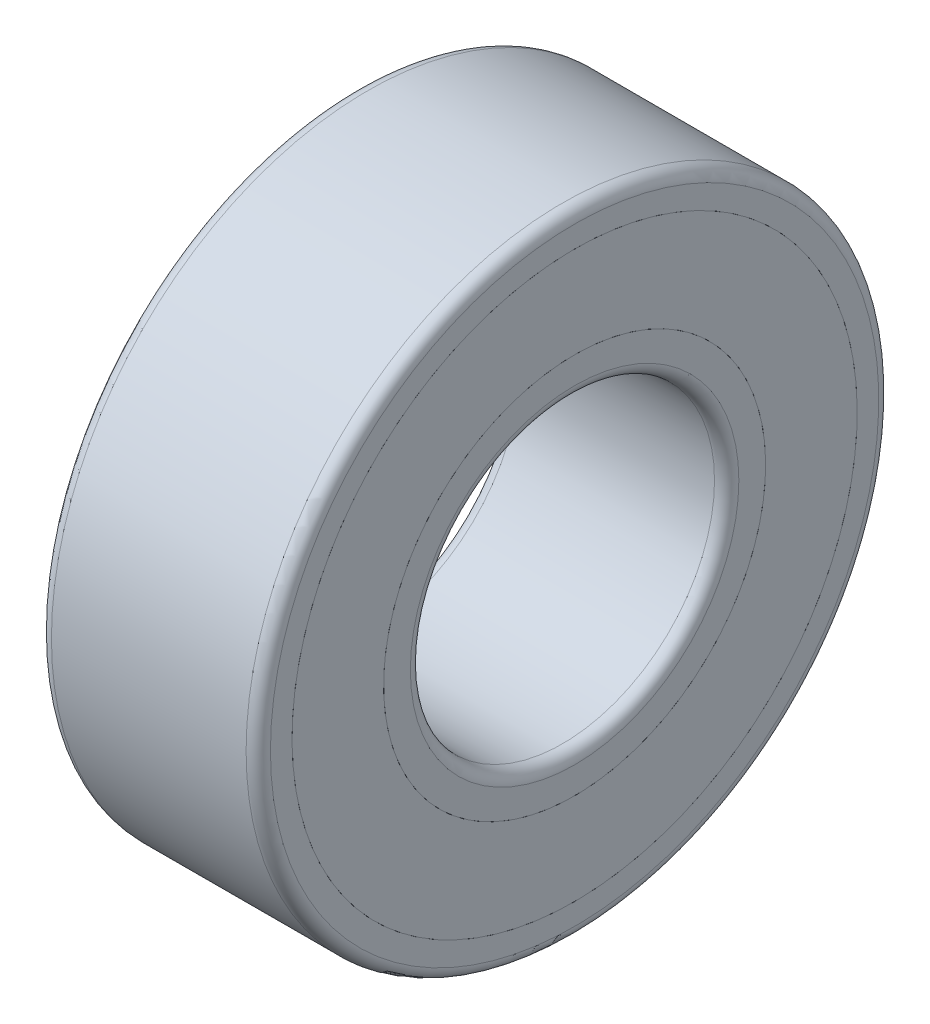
ISO-10303-21;
HEADER;
FILE_DESCRIPTION(('STEP AP214'),'2;1');
FILE_NAME('part.step','',(''),(''),'','','');
FILE_SCHEMA(('AUTOMOTIVE_DESIGN { 1 0 10303 214 1 1 1 1 }'));
ENDSEC;
DATA;
#1=APPLICATION_CONTEXT('core data for automotive mechanical design processes');
#2=APPLICATION_PROTOCOL_DEFINITION('international standard','automotive_design',2000,#1);
#3=PRODUCT_CONTEXT('',#1,'mechanical');
#4=PRODUCT('Part','Part','',(#3));
#5=PRODUCT_RELATED_PRODUCT_CATEGORY('part','',(#4));
#6=PRODUCT_DEFINITION_FORMATION('','',#4);
#7=PRODUCT_DEFINITION_CONTEXT('part definition',#1,'design');
#8=PRODUCT_DEFINITION('design','',#6,#7);
#9=PRODUCT_DEFINITION_SHAPE('','',#8);
#10=(LENGTH_UNIT() NAMED_UNIT(*) SI_UNIT(.MILLI.,.METRE.));
#11=(NAMED_UNIT(*) PLANE_ANGLE_UNIT() SI_UNIT($,.RADIAN.));
#12=(NAMED_UNIT(*) SI_UNIT($,.STERADIAN.) SOLID_ANGLE_UNIT());
#13=UNCERTAINTY_MEASURE_WITH_UNIT(LENGTH_MEASURE(1.E-05),#10,'distance_accuracy_value','');
#14=(GEOMETRIC_REPRESENTATION_CONTEXT(3) GLOBAL_UNCERTAINTY_ASSIGNED_CONTEXT((#13)) GLOBAL_UNIT_ASSIGNED_CONTEXT((#10,
#11,#12)) REPRESENTATION_CONTEXT('',''));
#15=CARTESIAN_POINT('',(0.,0.,0.));
#16=DIRECTION('',(0.,0.,1.));
#17=DIRECTION('',(1.,0.,0.));
#18=AXIS2_PLACEMENT_3D('',#15,#16,#17);
#19=CARTESIAN_POINT('',(-6.66678115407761,0.,0.));
#20=DIRECTION('',(-1.,0.,0.));
#21=DIRECTION('',(0.,-1.,0.));
#22=AXIS2_PLACEMENT_3D('',#19,#20,#21);
#23=CYLINDRICAL_SURFACE('',#22,16.45);
#24=CARTESIAN_POINT('',(-7.5,0.,0.));
#25=DIRECTION('',(-1.,0.,0.));
#26=DIRECTION('',(0.,0.,-1.));
#27=AXIS2_PLACEMENT_3D('',#24,#25,#26);
#28=CIRCLE('',#27,16.45);
#29=CARTESIAN_POINT('',(-7.50000000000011,16.45,0.));
#30=VERTEX_POINT('',#29);
#31=EDGE_CURVE('P0_E119',#30,#30,#28,.T.);
#32=ORIENTED_EDGE('',*,*,#31,.F.);
#33=EDGE_LOOP('',(#32));
#34=FACE_BOUND('',#33,.T.);
#35=CARTESIAN_POINT('',(-5.83356230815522,0.,0.));
#36=DIRECTION('',(-1.,0.,0.));
#37=DIRECTION('',(0.,0.,-1.));
#38=AXIS2_PLACEMENT_3D('',#35,#36,#37);
#39=CIRCLE('',#38,16.45);
#40=CARTESIAN_POINT('',(-5.83356230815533,16.45,0.));
#41=VERTEX_POINT('',#40);
#42=EDGE_CURVE('P0_E10',#41,#41,#39,.T.);
#43=ORIENTED_EDGE('',*,*,#42,.T.);
#44=EDGE_LOOP('',(#43));
#45=FACE_BOUND('',#44,.T.);
#46=ADVANCED_FACE('P0_F16',(#34,#45),#23,.T.);
#47=CARTESIAN_POINT('',(-3.38,0.,0.));
#48=DIRECTION('',(-1.,0.,0.));
#49=DIRECTION('',(0.,0.,-1.));
#50=AXIS2_PLACEMENT_3D('',#47,#48,#49);
#51=TOROIDAL_SURFACE('',#50,19.046,3.572);
#52=CARTESIAN_POINT('',(-0.926437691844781,0.,0.));
#53=DIRECTION('',(-1.,0.,0.));
#54=DIRECTION('',(0.,0.,-1.));
#55=AXIS2_PLACEMENT_3D('',#52,#53,#54);
#56=CIRCLE('',#55,16.45);
#57=CARTESIAN_POINT('',(-0.926437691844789,0.,16.45));
#58=VERTEX_POINT('',#57);
#59=EDGE_CURVE('P0_E27',#58,#58,#56,.T.);
#60=ORIENTED_EDGE('',*,*,#59,.T.);
#61=EDGE_LOOP('',(#60));
#62=FACE_BOUND('',#61,.T.);
#63=ORIENTED_EDGE('',*,*,#42,.F.);
#64=EDGE_LOOP('',(#63));
#65=FACE_BOUND('',#64,.T.);
#66=ADVANCED_FACE('P0_F141',(#62,#65),#51,.F.);
#67=CARTESIAN_POINT('',(0.,0.,0.));
#68=DIRECTION('',(-1.,0.,0.));
#69=DIRECTION('',(0.,-1.,0.));
#70=AXIS2_PLACEMENT_3D('',#67,#68,#69);
#71=CYLINDRICAL_SURFACE('',#70,16.45);
#72=ORIENTED_EDGE('',*,*,#59,.F.);
#73=EDGE_LOOP('',(#72));
#74=FACE_BOUND('',#73,.T.);
#75=CARTESIAN_POINT('',(0.926437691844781,0.,0.));
#76=DIRECTION('',(-1.,0.,0.));
#77=DIRECTION('',(0.,0.,-1.));
#78=AXIS2_PLACEMENT_3D('',#75,#76,#77);
#79=CIRCLE('',#78,16.45);
#80=CARTESIAN_POINT('',(0.926437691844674,16.45,0.));
#81=VERTEX_POINT('',#80);
#82=EDGE_CURVE('P0_E125',#81,#81,#79,.T.);
#83=ORIENTED_EDGE('',*,*,#82,.T.);
#84=EDGE_LOOP('',(#83));
#85=FACE_BOUND('',#84,.T.);
#86=ADVANCED_FACE('P0_F146',(#74,#85),#71,.T.);
#87=CARTESIAN_POINT('',(3.38,0.,0.));
#88=DIRECTION('',(-1.,0.,0.));
#89=DIRECTION('',(0.,0.,-1.));
#90=AXIS2_PLACEMENT_3D('',#87,#88,#89);
#91=TOROIDAL_SURFACE('',#90,19.046,3.572);
#92=CARTESIAN_POINT('',(5.83356230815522,0.,0.));
#93=DIRECTION('',(-1.,0.,0.));
#94=DIRECTION('',(0.,0.,-1.));
#95=AXIS2_PLACEMENT_3D('',#92,#93,#94);
#96=CIRCLE('',#95,16.45);
#97=CARTESIAN_POINT('',(5.83356230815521,0.,16.45));
#98=VERTEX_POINT('',#97);
#99=EDGE_CURVE('P0_E109',#98,#98,#96,.T.);
#100=ORIENTED_EDGE('',*,*,#99,.T.);
#101=EDGE_LOOP('',(#100));
#102=FACE_BOUND('',#101,.T.);
#103=ORIENTED_EDGE('',*,*,#82,.F.);
#104=EDGE_LOOP('',(#103));
#105=FACE_BOUND('',#104,.T.);
#106=ADVANCED_FACE('P0_F152',(#102,#105),#91,.F.);
#107=CARTESIAN_POINT('',(6.66678115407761,0.,0.));
#108=DIRECTION('',(-1.,0.,0.));
#109=DIRECTION('',(0.,-1.,0.));
#110=AXIS2_PLACEMENT_3D('',#107,#108,#109);
#111=CYLINDRICAL_SURFACE('',#110,16.45);
#112=ORIENTED_EDGE('',*,*,#99,.F.);
#113=EDGE_LOOP('',(#112));
#114=FACE_BOUND('',#113,.T.);
#115=CARTESIAN_POINT('',(7.5,0.,0.));
#116=DIRECTION('',(-1.,0.,0.));
#117=DIRECTION('',(0.,0.,-1.));
#118=AXIS2_PLACEMENT_3D('',#115,#116,#117);
#119=CIRCLE('',#118,16.45);
#120=CARTESIAN_POINT('',(7.49999999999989,16.45,0.));
#121=VERTEX_POINT('',#120);
#122=EDGE_CURVE('P0_E102',#121,#121,#119,.T.);
#123=ORIENTED_EDGE('',*,*,#122,.T.);
#124=EDGE_LOOP('',(#123));
#125=FACE_BOUND('',#124,.T.);
#126=ADVANCED_FACE('P0_F161',(#114,#125),#111,.T.);
#127=CARTESIAN_POINT('',(7.50000000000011,-16.45,0.));
#128=DIRECTION('',(1.,0.,0.));
#129=DIRECTION('',(0.,0.,1.));
#130=AXIS2_PLACEMENT_3D('',#127,#128,#129);
#131=PLANE('',#130);
#132=CARTESIAN_POINT('',(7.5,0.,0.));
#133=DIRECTION('',(-1.,0.,0.));
#134=DIRECTION('',(0.,0.,-1.));
#135=AXIS2_PLACEMENT_3D('',#132,#133,#134);
#136=CIRCLE('',#135,15.7);
#137=CARTESIAN_POINT('',(7.4999999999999,15.7,0.));
#138=VERTEX_POINT('',#137);
#139=EDGE_CURVE('P0_E97',#138,#138,#136,.T.);
#140=ORIENTED_EDGE('',*,*,#139,.T.);
#141=EDGE_LOOP('',(#140));
#142=FACE_BOUND('',#141,.T.);
#143=ORIENTED_EDGE('',*,*,#122,.F.);
#144=EDGE_LOOP('',(#143));
#145=FACE_BOUND('',#144,.T.);
#146=ADVANCED_FACE('P0_F98',(#142,#145),#131,.T.);
#147=CARTESIAN_POINT('',(8.25,0.,0.));
#148=DIRECTION('',(-1.,0.,0.));
#149=DIRECTION('',(0.,-1.,0.));
#150=AXIS2_PLACEMENT_3D('',#147,#148,#149);
#151=CYLINDRICAL_SURFACE('',#150,15.7);
#152=ORIENTED_EDGE('',*,*,#139,.F.);
#153=EDGE_LOOP('',(#152));
#154=FACE_BOUND('',#153,.T.);
#155=CARTESIAN_POINT('',(9.,0.,0.));
#156=DIRECTION('',(-1.,0.,0.));
#157=DIRECTION('',(0.,0.,-1.));
#158=AXIS2_PLACEMENT_3D('',#155,#156,#157);
#159=CIRCLE('',#158,15.7);
#160=CARTESIAN_POINT('',(8.9999999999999,15.7,0.));
#161=VERTEX_POINT('',#160);
#162=EDGE_CURVE('P0_E103',#161,#161,#159,.T.);
#163=ORIENTED_EDGE('',*,*,#162,.T.);
#164=EDGE_LOOP('',(#163));
#165=FACE_BOUND('',#164,.T.);
#166=ADVANCED_FACE('P0_F160',(#154,#165),#151,.T.);
#167=CARTESIAN_POINT('',(9.0000000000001,-15.7,0.));
#168=DIRECTION('',(1.,0.,0.));
#169=DIRECTION('',(0.,0.,1.));
#170=AXIS2_PLACEMENT_3D('',#167,#168,#169);
#171=PLANE('',#170);
#172=CARTESIAN_POINT('',(9.,0.,0.));
#173=DIRECTION('',(-1.,0.,0.));
#174=DIRECTION('',(0.,0.,-1.));
#175=AXIS2_PLACEMENT_3D('',#172,#173,#174);
#176=CIRCLE('',#175,13.5);
#177=CARTESIAN_POINT('',(9.,0.,13.5));
#178=VERTEX_POINT('',#177);
#179=EDGE_CURVE('P0_E52',#178,#178,#176,.T.);
#180=ORIENTED_EDGE('',*,*,#179,.T.);
#181=EDGE_LOOP('',(#180));
#182=FACE_BOUND('',#181,.T.);
#183=ORIENTED_EDGE('',*,*,#162,.F.);
#184=EDGE_LOOP('',(#183));
#185=FACE_BOUND('',#184,.T.);
#186=ADVANCED_FACE('P0_F164',(#182,#185),#171,.T.);
#187=CARTESIAN_POINT('',(8.,0.,0.));
#188=DIRECTION('',(-1.,0.,0.));
#189=DIRECTION('',(0.,0.,-1.));
#190=AXIS2_PLACEMENT_3D('',#187,#188,#189);
#191=TOROIDAL_SURFACE('',#190,13.5,1.);
#192=ORIENTED_EDGE('',*,*,#179,.F.);
#193=EDGE_LOOP('',(#192));
#194=FACE_BOUND('',#193,.T.);
#195=CARTESIAN_POINT('',(8.,0.,0.));
#196=DIRECTION('',(-1.,0.,0.));
#197=DIRECTION('',(0.,0.,-1.));
#198=AXIS2_PLACEMENT_3D('',#195,#196,#197);
#199=CIRCLE('',#198,12.5);
#200=CARTESIAN_POINT('',(8.,0.,12.5));
#201=VERTEX_POINT('',#200);
#202=EDGE_CURVE('P0_E20',#201,#201,#199,.T.);
#203=ORIENTED_EDGE('',*,*,#202,.T.);
#204=EDGE_LOOP('',(#203));
#205=FACE_BOUND('',#204,.T.);
#206=ADVANCED_FACE('P0_F157',(#194,#205),#191,.T.);
#207=CARTESIAN_POINT('',(0.,0.,0.));
#208=DIRECTION('',(-1.,0.,0.));
#209=DIRECTION('',(0.,-1.,0.));
#210=AXIS2_PLACEMENT_3D('',#207,#208,#209);
#211=CYLINDRICAL_SURFACE('',#210,12.5);
#212=CARTESIAN_POINT('',(-8.,0.,0.));
#213=DIRECTION('',(-1.,0.,0.));
#214=DIRECTION('',(0.,0.,-1.));
#215=AXIS2_PLACEMENT_3D('',#212,#213,#214);
#216=CIRCLE('',#215,12.5);
#217=CARTESIAN_POINT('',(-8.,0.,12.5));
#218=VERTEX_POINT('',#217);
#219=EDGE_CURVE('P0_E72',#218,#218,#216,.T.);
#220=ORIENTED_EDGE('',*,*,#219,.T.);
#221=EDGE_LOOP('',(#220));
#222=FACE_BOUND('',#221,.T.);
#223=ORIENTED_EDGE('',*,*,#202,.F.);
#224=EDGE_LOOP('',(#223));
#225=FACE_BOUND('',#224,.T.);
#226=ADVANCED_FACE('P0_F154',(#222,#225),#211,.F.);
#227=CARTESIAN_POINT('',(-8.,0.,0.));
#228=DIRECTION('',(-1.,0.,0.));
#229=DIRECTION('',(0.,0.,-1.));
#230=AXIS2_PLACEMENT_3D('',#227,#228,#229);
#231=TOROIDAL_SURFACE('',#230,13.5,1.);
#232=ORIENTED_EDGE('',*,*,#219,.F.);
#233=EDGE_LOOP('',(#232));
#234=FACE_BOUND('',#233,.T.);
#235=CARTESIAN_POINT('',(-9.,0.,0.));
#236=DIRECTION('',(-1.,0.,0.));
#237=DIRECTION('',(0.,0.,-1.));
#238=AXIS2_PLACEMENT_3D('',#235,#236,#237);
#239=CIRCLE('',#238,13.5);
#240=CARTESIAN_POINT('',(-9.,0.,13.5));
#241=VERTEX_POINT('',#240);
#242=EDGE_CURVE('P0_E123',#241,#241,#239,.T.);
#243=ORIENTED_EDGE('',*,*,#242,.T.);
#244=EDGE_LOOP('',(#243));
#245=FACE_BOUND('',#244,.T.);
#246=ADVANCED_FACE('P0_F18',(#234,#245),#231,.T.);
#247=CARTESIAN_POINT('',(-9.,-13.5,0.));
#248=DIRECTION('',(-1.,0.,0.));
#249=DIRECTION('',(0.,-1.,0.));
#250=AXIS2_PLACEMENT_3D('',#247,#248,#249);
#251=PLANE('',#250);
#252=ORIENTED_EDGE('',*,*,#242,.F.);
#253=EDGE_LOOP('',(#252));
#254=FACE_BOUND('',#253,.T.);
#255=CARTESIAN_POINT('',(-9.,0.,0.));
#256=DIRECTION('',(-1.,0.,0.));
#257=DIRECTION('',(0.,0.,-1.));
#258=AXIS2_PLACEMENT_3D('',#255,#256,#257);
#259=CIRCLE('',#258,15.7);
#260=CARTESIAN_POINT('',(-9.0000000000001,15.7,0.));
#261=VERTEX_POINT('',#260);
#262=EDGE_CURVE('P0_E118',#261,#261,#259,.T.);
#263=ORIENTED_EDGE('',*,*,#262,.T.);
#264=EDGE_LOOP('',(#263));
#265=FACE_BOUND('',#264,.T.);
#266=ADVANCED_FACE('P0_F169',(#254,#265),#251,.T.);
#267=CARTESIAN_POINT('',(-8.25,0.,0.));
#268=DIRECTION('',(-1.,0.,0.));
#269=DIRECTION('',(0.,-1.,0.));
#270=AXIS2_PLACEMENT_3D('',#267,#268,#269);
#271=CYLINDRICAL_SURFACE('',#270,15.7);
#272=ORIENTED_EDGE('',*,*,#262,.F.);
#273=EDGE_LOOP('',(#272));
#274=FACE_BOUND('',#273,.T.);
#275=CARTESIAN_POINT('',(-7.5,0.,0.));
#276=DIRECTION('',(-1.,0.,0.));
#277=DIRECTION('',(0.,0.,-1.));
#278=AXIS2_PLACEMENT_3D('',#275,#276,#277);
#279=CIRCLE('',#278,15.7);
#280=CARTESIAN_POINT('',(-7.5000000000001,15.7,0.));
#281=VERTEX_POINT('',#280);
#282=EDGE_CURVE('P0_E116',#281,#281,#279,.T.);
#283=ORIENTED_EDGE('',*,*,#282,.T.);
#284=EDGE_LOOP('',(#283));
#285=FACE_BOUND('',#284,.T.);
#286=ADVANCED_FACE('P0_F166',(#274,#285),#271,.T.);
#287=CARTESIAN_POINT('',(-7.4999999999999,-15.7,0.));
#288=DIRECTION('',(-1.,0.,0.));
#289=DIRECTION('',(0.,-1.,0.));
#290=AXIS2_PLACEMENT_3D('',#287,#288,#289);
#291=PLANE('',#290);
#292=ORIENTED_EDGE('',*,*,#282,.F.);
#293=EDGE_LOOP('',(#292));
#294=FACE_BOUND('',#293,.T.);
#295=ORIENTED_EDGE('',*,*,#31,.T.);
#296=EDGE_LOOP('',(#295));
#297=FACE_BOUND('',#296,.T.);
#298=ADVANCED_FACE('P0_F138',(#294,#297),#291,.T.);
#299=CLOSED_SHELL('',(#46,#66,#86,#106,#126,#146,#166,#186,#206,#226,#246,#266,#286,#298));
#300=MANIFOLD_SOLID_BREP('P0_B1',#299);
#301=CARTESIAN_POINT('',(0.,0.,0.));
#302=DIRECTION('',(1.,0.,0.));
#303=DIRECTION('',(0.,1.,0.));
#304=AXIS2_PLACEMENT_3D('',#301,#302,#303);
#305=CYLINDRICAL_SURFACE('',#304,26.);
#306=CARTESIAN_POINT('',(8.,0.,0.));
#307=DIRECTION('',(1.,0.,0.));
#308=DIRECTION('',(0.,0.,-1.));
#309=AXIS2_PLACEMENT_3D('',#306,#307,#308);
#310=CIRCLE('',#309,26.);
#311=CARTESIAN_POINT('',(8.,-26.,0.));
#312=VERTEX_POINT('',#311);
#313=EDGE_CURVE('P1_E97',#312,#312,#310,.T.);
#314=ORIENTED_EDGE('',*,*,#313,.F.);
#315=EDGE_LOOP('',(#314));
#316=FACE_BOUND('',#315,.T.);
#317=CARTESIAN_POINT('',(-8.,0.,0.));
#318=DIRECTION('',(1.,0.,0.));
#319=DIRECTION('',(0.,0.,-1.));
#320=AXIS2_PLACEMENT_3D('',#317,#318,#319);
#321=CIRCLE('',#320,26.);
#322=CARTESIAN_POINT('',(-8.,0.,26.));
#323=VERTEX_POINT('',#322);
#324=EDGE_CURVE('P1_E11',#323,#323,#321,.T.);
#325=ORIENTED_EDGE('',*,*,#324,.T.);
#326=EDGE_LOOP('',(#325));
#327=FACE_BOUND('',#326,.T.);
#328=ADVANCED_FACE('P1_F17',(#316,#327),#305,.T.);
#329=CARTESIAN_POINT('',(-8.,0.,0.));
#330=DIRECTION('',(1.,0.,0.));
#331=DIRECTION('',(0.,0.,-1.));
#332=AXIS2_PLACEMENT_3D('',#329,#330,#331);
#333=TOROIDAL_SURFACE('',#332,25.,1.);
#334=ORIENTED_EDGE('',*,*,#324,.F.);
#335=EDGE_LOOP('',(#334));
#336=FACE_BOUND('',#335,.T.);
#337=CARTESIAN_POINT('',(-9.,0.,0.));
#338=DIRECTION('',(1.,0.,0.));
#339=DIRECTION('',(0.,0.,-1.));
#340=AXIS2_PLACEMENT_3D('',#337,#338,#339);
#341=CIRCLE('',#340,25.);
#342=CARTESIAN_POINT('',(-9.,0.,25.));
#343=VERTEX_POINT('',#342);
#344=EDGE_CURVE('P1_E28',#343,#343,#341,.T.);
#345=ORIENTED_EDGE('',*,*,#344,.T.);
#346=EDGE_LOOP('',(#345));
#347=FACE_BOUND('',#346,.T.);
#348=ADVANCED_FACE('P1_F19',(#336,#347),#333,.T.);
#349=CARTESIAN_POINT('',(-9.,25.,0.));
#350=DIRECTION('',(-1.,0.,0.));
#351=DIRECTION('',(0.,0.,1.));
#352=AXIS2_PLACEMENT_3D('',#349,#350,#351);
#353=PLANE('',#352);
#354=CARTESIAN_POINT('',(-9.,0.,0.));
#355=DIRECTION('',(1.,0.,0.));
#356=DIRECTION('',(0.,0.,-1.));
#357=AXIS2_PLACEMENT_3D('',#354,#355,#356);
#358=CIRCLE('',#357,23.225);
#359=CARTESIAN_POINT('',(-9.,-23.225,0.));
#360=VERTEX_POINT('',#359);
#361=EDGE_CURVE('P1_E89',#360,#360,#358,.T.);
#362=ORIENTED_EDGE('',*,*,#361,.T.);
#363=EDGE_LOOP('',(#362));
#364=FACE_BOUND('',#363,.T.);
#365=ORIENTED_EDGE('',*,*,#344,.F.);
#366=EDGE_LOOP('',(#365));
#367=FACE_BOUND('',#366,.T.);
#368=ADVANCED_FACE('P1_F112',(#364,#367),#353,.T.);
#369=CARTESIAN_POINT('',(-8.25,0.,0.));
#370=DIRECTION('',(1.,0.,0.));
#371=DIRECTION('',(0.,1.,0.));
#372=AXIS2_PLACEMENT_3D('',#369,#370,#371);
#373=CYLINDRICAL_SURFACE('',#372,23.225);
#374=CARTESIAN_POINT('',(-7.5,0.,0.));
#375=DIRECTION('',(1.,0.,0.));
#376=DIRECTION('',(0.,0.,-1.));
#377=AXIS2_PLACEMENT_3D('',#374,#375,#376);
#378=CIRCLE('',#377,23.225);
#379=CARTESIAN_POINT('',(-7.5,-23.225,0.));
#380=VERTEX_POINT('',#379);
#381=EDGE_CURVE('P1_E21',#380,#380,#378,.T.);
#382=ORIENTED_EDGE('',*,*,#381,.T.);
#383=EDGE_LOOP('',(#382));
#384=FACE_BOUND('',#383,.T.);
#385=ORIENTED_EDGE('',*,*,#361,.F.);
#386=EDGE_LOOP('',(#385));
#387=FACE_BOUND('',#386,.T.);
#388=ADVANCED_FACE('P1_F122',(#384,#387),#373,.F.);
#389=CARTESIAN_POINT('',(-7.5,23.225,0.));
#390=DIRECTION('',(-1.,0.,0.));
#391=DIRECTION('',(0.,0.,1.));
#392=AXIS2_PLACEMENT_3D('',#389,#390,#391);
#393=PLANE('',#392);
#394=CARTESIAN_POINT('',(-7.5,0.,0.));
#395=DIRECTION('',(1.,0.,0.));
#396=DIRECTION('',(0.,0.,-1.));
#397=AXIS2_PLACEMENT_3D('',#394,#395,#396);
#398=CIRCLE('',#397,21.6528802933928);
#399=CARTESIAN_POINT('',(-7.5,0.,21.6528802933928));
#400=VERTEX_POINT('',#399);
#401=EDGE_CURVE('P1_E82',#400,#400,#398,.T.);
#402=ORIENTED_EDGE('',*,*,#401,.T.);
#403=EDGE_LOOP('',(#402));
#404=FACE_BOUND('',#403,.T.);
#405=ORIENTED_EDGE('',*,*,#381,.F.);
#406=EDGE_LOOP('',(#405));
#407=FACE_BOUND('',#406,.T.);
#408=ADVANCED_FACE('P1_F127',(#404,#407),#393,.T.);
#409=CARTESIAN_POINT('',(0.,0.,0.));
#410=DIRECTION('',(0.,0.,1.));
#411=DIRECTION('',(1.,0.,0.));
#412=AXIS2_PLACEMENT_3D('',#409,#410,#411);
#413=SPHERICAL_SURFACE('',#412,22.915);
#414=CARTESIAN_POINT('',(0.,0.,0.));
#415=DIRECTION('',(1.,0.,0.));
#416=DIRECTION('',(0.,0.,-1.));
#417=AXIS2_PLACEMENT_3D('',#414,#415,#416);
#418=SPHERICAL_SURFACE('',#417,22.915);
#419=CARTESIAN_POINT('',(7.5,0.,0.));
#420=DIRECTION('',(1.,0.,0.));
#421=DIRECTION('',(0.,0.,-1.));
#422=AXIS2_PLACEMENT_3D('',#419,#420,#421);
#423=CIRCLE('',#422,21.6528802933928);
#424=CARTESIAN_POINT('',(7.5,21.6528802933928,0.));
#425=VERTEX_POINT('',#424);
#426=EDGE_CURVE('P1_E66',#425,#425,#423,.T.);
#427=ORIENTED_EDGE('',*,*,#426,.T.);
#428=EDGE_LOOP('',(#427));
#429=FACE_BOUND('',#428,.T.);
#430=ORIENTED_EDGE('',*,*,#401,.F.);
#431=EDGE_LOOP('',(#430));
#432=FACE_BOUND('',#431,.T.);
#433=ADVANCED_FACE('P1_F116',(#429,#432),#418,.F.);
#434=CARTESIAN_POINT('',(7.5,21.6528802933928,0.));
#435=DIRECTION('',(1.,0.,0.));
#436=DIRECTION('',(0.,1.,0.));
#437=AXIS2_PLACEMENT_3D('',#434,#435,#436);
#438=PLANE('',#437);
#439=ORIENTED_EDGE('',*,*,#426,.F.);
#440=EDGE_LOOP('',(#439));
#441=FACE_BOUND('',#440,.T.);
#442=CARTESIAN_POINT('',(7.5,0.,0.));
#443=DIRECTION('',(1.,0.,0.));
#444=DIRECTION('',(0.,0.,-1.));
#445=AXIS2_PLACEMENT_3D('',#442,#443,#444);
#446=CIRCLE('',#445,23.225);
#447=CARTESIAN_POINT('',(7.5,-23.225,0.));
#448=VERTEX_POINT('',#447);
#449=EDGE_CURVE('P1_E72',#448,#448,#446,.T.);
#450=ORIENTED_EDGE('',*,*,#449,.T.);
#451=EDGE_LOOP('',(#450));
#452=FACE_BOUND('',#451,.T.);
#453=ADVANCED_FACE('P1_F73',(#441,#452),#438,.T.);
#454=CARTESIAN_POINT('',(8.25,0.,0.));
#455=DIRECTION('',(1.,0.,0.));
#456=DIRECTION('',(0.,1.,0.));
#457=AXIS2_PLACEMENT_3D('',#454,#455,#456);
#458=CYLINDRICAL_SURFACE('',#457,23.225);
#459=CARTESIAN_POINT('',(9.,0.,0.));
#460=DIRECTION('',(1.,0.,0.));
#461=DIRECTION('',(0.,0.,-1.));
#462=AXIS2_PLACEMENT_3D('',#459,#460,#461);
#463=CIRCLE('',#462,23.225);
#464=CARTESIAN_POINT('',(9.,-23.225,0.));
#465=VERTEX_POINT('',#464);
#466=EDGE_CURVE('P1_E76',#465,#465,#463,.T.);
#467=ORIENTED_EDGE('',*,*,#466,.T.);
#468=EDGE_LOOP('',(#467));
#469=FACE_BOUND('',#468,.T.);
#470=ORIENTED_EDGE('',*,*,#449,.F.);
#471=EDGE_LOOP('',(#470));
#472=FACE_BOUND('',#471,.T.);
#473=ADVANCED_FACE('P1_F142',(#469,#472),#458,.F.);
#474=CARTESIAN_POINT('',(9.,23.225,0.));
#475=DIRECTION('',(1.,0.,0.));
#476=DIRECTION('',(0.,1.,0.));
#477=AXIS2_PLACEMENT_3D('',#474,#475,#476);
#478=PLANE('',#477);
#479=ORIENTED_EDGE('',*,*,#466,.F.);
#480=EDGE_LOOP('',(#479));
#481=FACE_BOUND('',#480,.T.);
#482=CARTESIAN_POINT('',(9.,0.,0.));
#483=DIRECTION('',(1.,0.,0.));
#484=DIRECTION('',(0.,0.,-1.));
#485=AXIS2_PLACEMENT_3D('',#482,#483,#484);
#486=CIRCLE('',#485,25.);
#487=CARTESIAN_POINT('',(9.,0.,25.));
#488=VERTEX_POINT('',#487);
#489=EDGE_CURVE('P1_E84',#488,#488,#486,.T.);
#490=ORIENTED_EDGE('',*,*,#489,.T.);
#491=EDGE_LOOP('',(#490));
#492=FACE_BOUND('',#491,.T.);
#493=ADVANCED_FACE('P1_F119',(#481,#492),#478,.T.);
#494=CARTESIAN_POINT('',(8.,0.,0.));
#495=DIRECTION('',(1.,0.,0.));
#496=DIRECTION('',(0.,0.,-1.));
#497=AXIS2_PLACEMENT_3D('',#494,#495,#496);
#498=TOROIDAL_SURFACE('',#497,25.,1.);
#499=ORIENTED_EDGE('',*,*,#489,.F.);
#500=EDGE_LOOP('',(#499));
#501=FACE_BOUND('',#500,.T.);
#502=ORIENTED_EDGE('',*,*,#313,.T.);
#503=EDGE_LOOP('',(#502));
#504=FACE_BOUND('',#503,.T.);
#505=ADVANCED_FACE('P1_F104',(#501,#504),#498,.T.);
#506=CLOSED_SHELL('',(#328,#348,#368,#388,#408,#433,#453,#473,#493,#505));
#507=MANIFOLD_SOLID_BREP('P1_B1',#506);
#508=CARTESIAN_POINT('',(3.38000000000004,-19.046,0.));
#509=DIRECTION('',(0.925213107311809,-0.276991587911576,0.259338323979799));
#510=DIRECTION('',(0.376970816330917,0.748950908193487,-0.544945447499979));
#511=AXIS2_PLACEMENT_3D('',#508,#509,#510);
#512=SPHERICAL_SURFACE('',#511,3.572);
#513=CARTESIAN_POINT('',(6.68486121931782,-20.0354139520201,0.926356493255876));
#514=VERTEX_POINT('',#513);
#515=VERTEX_LOOP('',#514);
#516=FACE_BOUND('',#515,.T.);
#517=ADVANCED_FACE('P2_F13',(#516),#512,.T.);
#518=CLOSED_SHELL('',(#517));
#519=MANIFOLD_SOLID_BREP('P2_B1',#518);
#520=CARTESIAN_POINT('',(3.3799999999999,0.,19.046));
#521=DIRECTION('',(0.925213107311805,0.259338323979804,0.276991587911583));
#522=DIRECTION('',(0.376970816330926,-0.544945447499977,-0.748950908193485));
#523=AXIS2_PLACEMENT_3D('',#520,#521,#522);
#524=SPHERICAL_SURFACE('',#523,3.572);
#525=CARTESIAN_POINT('',(6.68486121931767,0.926356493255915,20.0354139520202));
#526=VERTEX_POINT('',#525);
#527=VERTEX_LOOP('',#526);
#528=FACE_BOUND('',#527,.T.);
#529=ADVANCED_FACE('P3_F13',(#528),#524,.T.);
#530=CLOSED_SHELL('',(#529));
#531=MANIFOLD_SOLID_BREP('P3_B1',#530);
#532=CARTESIAN_POINT('',(3.37999999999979,19.046,0.));
#533=DIRECTION('',(0.925213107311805,0.276991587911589,-0.259338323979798));
#534=DIRECTION('',(0.376970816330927,-0.748950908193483,0.544945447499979));
#535=AXIS2_PLACEMENT_3D('',#532,#533,#534);
#536=SPHERICAL_SURFACE('',#535,3.572);
#537=CARTESIAN_POINT('',(6.68486121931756,20.0354139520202,-0.926356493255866));
#538=VERTEX_POINT('',#537);
#539=VERTEX_LOOP('',#538);
#540=FACE_BOUND('',#539,.T.);
#541=ADVANCED_FACE('P4_F13',(#540),#536,.T.);
#542=CLOSED_SHELL('',(#541));
#543=MANIFOLD_SOLID_BREP('P4_B1',#542);
#544=CARTESIAN_POINT('',(3.37999999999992,0.,-19.046));
#545=DIRECTION('',(0.925213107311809,-0.259338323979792,-0.276991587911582));
#546=DIRECTION('',(0.376970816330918,0.544945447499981,0.748950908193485));
#547=AXIS2_PLACEMENT_3D('',#544,#545,#546);
#548=SPHERICAL_SURFACE('',#547,3.572);
#549=CARTESIAN_POINT('',(6.6848612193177,-0.926356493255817,-20.0354139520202));
#550=VERTEX_POINT('',#549);
#551=VERTEX_LOOP('',#550);
#552=FACE_BOUND('',#551,.T.);
#553=ADVANCED_FACE('P5_F13',(#552),#548,.T.);
#554=CLOSED_SHELL('',(#553));
#555=MANIFOLD_SOLID_BREP('P5_B1',#554);
#556=CARTESIAN_POINT('',(-3.38000000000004,-13.467555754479,13.467555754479));
#557=DIRECTION('',(-0.596689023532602,-0.775223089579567,-0.207343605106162));
#558=DIRECTION('',(0.135871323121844,-0.352248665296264,0.925991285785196));
#559=AXIS2_PLACEMENT_3D('',#556,#557,#558);
#560=SPHERICAL_SURFACE('',#559,3.572);
#561=CARTESIAN_POINT('',(-5.51137319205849,-16.2366526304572,12.7269243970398));
#562=VERTEX_POINT('',#561);
#563=VERTEX_LOOP('',#562);
#564=FACE_BOUND('',#563,.T.);
#565=ADVANCED_FACE('P6_F13',(#564),#560,.T.);
#566=CLOSED_SHELL('',(#565));
#567=MANIFOLD_SOLID_BREP('P6_B1',#566);
#568=CARTESIAN_POINT('',(-3.38000000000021,13.467555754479,13.467555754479));
#569=DIRECTION('',(-0.596689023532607,-0.207343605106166,0.775223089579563));
#570=DIRECTION('',(0.135871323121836,0.925991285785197,0.352248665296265));
#571=AXIS2_PLACEMENT_3D('',#568,#569,#570);
#572=SPHERICAL_SURFACE('',#571,3.572);
#573=CARTESIAN_POINT('',(-5.51137319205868,12.7269243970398,16.2366526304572));
#574=VERTEX_POINT('',#573);
#575=VERTEX_LOOP('',#574);
#576=FACE_BOUND('',#575,.T.);
#577=ADVANCED_FACE('P7_F13',(#576),#572,.T.);
#578=CLOSED_SHELL('',(#577));
#579=MANIFOLD_SOLID_BREP('P7_B1',#578);
#580=CARTESIAN_POINT('',(-3.3800000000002,13.467555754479,-13.467555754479));
#581=DIRECTION('',(-0.596689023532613,0.775223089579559,0.207343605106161));
#582=DIRECTION('',(0.135871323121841,0.352248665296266,-0.925991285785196));
#583=AXIS2_PLACEMENT_3D('',#580,#581,#582);
#584=SPHERICAL_SURFACE('',#583,3.572);
#585=CARTESIAN_POINT('',(-5.51137319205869,16.2366526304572,-12.7269243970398));
#586=VERTEX_POINT('',#585);
#587=VERTEX_LOOP('',#586);
#588=FACE_BOUND('',#587,.T.);
#589=ADVANCED_FACE('P8_F13',(#588),#584,.T.);
#590=CLOSED_SHELL('',(#589));
#591=MANIFOLD_SOLID_BREP('P8_B1',#590);
#592=CARTESIAN_POINT('',(-3.38,-13.467555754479,-13.467555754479));
#593=DIRECTION('',(-0.596689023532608,0.207343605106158,-0.775223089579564));
#594=DIRECTION('',(0.135871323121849,-0.925991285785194,-0.352248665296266));
#595=AXIS2_PLACEMENT_3D('',#592,#593,#594);
#596=SPHERICAL_SURFACE('',#595,3.572);
#597=CARTESIAN_POINT('',(-5.51137319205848,-12.7269243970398,-16.2366526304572));
#598=VERTEX_POINT('',#597);
#599=VERTEX_LOOP('',#598);
#600=FACE_BOUND('',#599,.T.);
#601=ADVANCED_FACE('P9_F13',(#600),#596,.T.);
#602=CLOSED_SHELL('',(#601));
#603=MANIFOLD_SOLID_BREP('P9_B1',#602);
#604=CARTESIAN_POINT('',(-9.,-14.0188379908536,18.5168249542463));
#605=DIRECTION('',(-1.,0.,0.));
#606=DIRECTION('',(0.,-0.79727986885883,-0.603609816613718));
#607=AXIS2_PLACEMENT_3D('',#604,#605,#606);
#608=PLANE('',#607);
#609=CARTESIAN_POINT('',(-9.,0.,0.));
#610=DIRECTION('',(1.,0.,0.));
#611=DIRECTION('',(0.,0.79727986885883,0.603609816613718));
#612=AXIS2_PLACEMENT_3D('',#609,#610,#611);
#613=CIRCLE('',#612,15.7);
#614=CARTESIAN_POINT('',(-9.,9.47667412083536,-12.5172939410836));
#615=VERTEX_POINT('',#614);
#616=EDGE_CURVE('P10_E11',#615,#615,#613,.T.);
#617=ORIENTED_EDGE('',*,*,#616,.T.);
#618=EDGE_LOOP('',(#617));
#619=FACE_BOUND('',#618,.T.);
#620=CARTESIAN_POINT('',(-9.,0.,0.));
#621=DIRECTION('',(1.,0.,0.));
#622=DIRECTION('',(0.,0.79727986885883,0.603609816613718));
#623=AXIS2_PLACEMENT_3D('',#620,#621,#622);
#624=CIRCLE('',#623,23.225);
#625=CARTESIAN_POINT('',(-9.,14.0188379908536,-18.5168249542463));
#626=VERTEX_POINT('',#625);
#627=EDGE_CURVE('P10_E21',#626,#626,#624,.T.);
#628=ORIENTED_EDGE('',*,*,#627,.F.);
#629=EDGE_LOOP('',(#628));
#630=FACE_BOUND('',#629,.T.);
#631=ADVANCED_FACE('P10_F17',(#619,#630),#608,.T.);
#632=CARTESIAN_POINT('',(-8.25,0.,0.));
#633=DIRECTION('',(1.,0.,0.));
#634=DIRECTION('',(0.,-0.603609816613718,0.79727986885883));
#635=AXIS2_PLACEMENT_3D('',#632,#633,#634);
#636=CYLINDRICAL_SURFACE('',#635,15.7);
#637=CARTESIAN_POINT('',(-7.5,0.,0.));
#638=DIRECTION('',(1.,0.,0.));
#639=DIRECTION('',(0.,0.79727986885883,0.603609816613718));
#640=AXIS2_PLACEMENT_3D('',#637,#638,#639);
#641=CIRCLE('',#640,15.7);
#642=CARTESIAN_POINT('',(-7.5,9.47667412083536,-12.5172939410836));
#643=VERTEX_POINT('',#642);
#644=EDGE_CURVE('P10_E28',#643,#643,#641,.T.);
#645=ORIENTED_EDGE('',*,*,#644,.T.);
#646=EDGE_LOOP('',(#645));
#647=FACE_BOUND('',#646,.T.);
#648=ORIENTED_EDGE('',*,*,#616,.F.);
#649=EDGE_LOOP('',(#648));
#650=FACE_BOUND('',#649,.T.);
#651=ADVANCED_FACE('P10_F64',(#647,#650),#636,.F.);
#652=CARTESIAN_POINT('',(-7.5,-9.47667412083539,12.5172939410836));
#653=DIRECTION('',(1.,0.,0.));
#654=DIRECTION('',(0.,-0.603609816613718,0.79727986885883));
#655=AXIS2_PLACEMENT_3D('',#652,#653,#654);
#656=PLANE('',#655);
#657=ORIENTED_EDGE('',*,*,#644,.F.);
#658=EDGE_LOOP('',(#657));
#659=FACE_BOUND('',#658,.T.);
#660=CARTESIAN_POINT('',(-7.5,0.,0.));
#661=DIRECTION('',(1.,0.,0.));
#662=DIRECTION('',(0.,0.79727986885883,0.603609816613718));
#663=AXIS2_PLACEMENT_3D('',#660,#661,#662);
#664=CIRCLE('',#663,23.225);
#665=CARTESIAN_POINT('',(-7.5,14.0188379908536,-18.5168249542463));
#666=VERTEX_POINT('',#665);
#667=EDGE_CURVE('P10_E46',#666,#666,#664,.T.);
#668=ORIENTED_EDGE('',*,*,#667,.T.);
#669=EDGE_LOOP('',(#668));
#670=FACE_BOUND('',#669,.T.);
#671=ADVANCED_FACE('P10_F67',(#659,#670),#656,.T.);
#672=CARTESIAN_POINT('',(-8.25,0.,0.));
#673=DIRECTION('',(1.,0.,0.));
#674=DIRECTION('',(0.,-0.603609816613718,0.79727986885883));
#675=AXIS2_PLACEMENT_3D('',#672,#673,#674);
#676=CYLINDRICAL_SURFACE('',#675,23.225);
#677=ORIENTED_EDGE('',*,*,#667,.F.);
#678=EDGE_LOOP('',(#677));
#679=FACE_BOUND('',#678,.T.);
#680=ORIENTED_EDGE('',*,*,#627,.T.);
#681=EDGE_LOOP('',(#680));
#682=FACE_BOUND('',#681,.T.);
#683=ADVANCED_FACE('P10_F19',(#679,#682),#676,.T.);
#684=CLOSED_SHELL('',(#631,#651,#671,#683));
#685=MANIFOLD_SOLID_BREP('P10_B1',#684);
#686=CARTESIAN_POINT('',(9.,20.7212041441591,10.4896293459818));
#687=DIRECTION('',(1.,0.,0.));
#688=DIRECTION('',(0.,0.451652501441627,-0.892193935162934));
#689=AXIS2_PLACEMENT_3D('',#686,#687,#688);
#690=PLANE('',#689);
#691=CARTESIAN_POINT('',(9.,0.,0.));
#692=DIRECTION('',(-1.,0.,0.));
#693=DIRECTION('',(0.,-0.451652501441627,0.892193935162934));
#694=AXIS2_PLACEMENT_3D('',#691,#692,#693);
#695=CIRCLE('',#694,15.7);
#696=CARTESIAN_POINT('',(9.,-14.007444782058,-7.09094427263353));
#697=VERTEX_POINT('',#696);
#698=EDGE_CURVE('P11_E10',#697,#697,#695,.T.);
#699=ORIENTED_EDGE('',*,*,#698,.T.);
#700=EDGE_LOOP('',(#699));
#701=FACE_BOUND('',#700,.T.);
#702=CARTESIAN_POINT('',(9.,0.,0.));
#703=DIRECTION('',(-1.,0.,0.));
#704=DIRECTION('',(0.,-0.451652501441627,0.892193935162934));
#705=AXIS2_PLACEMENT_3D('',#702,#703,#704);
#706=CIRCLE('',#705,23.225);
#707=CARTESIAN_POINT('',(9.,-20.7212041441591,-10.4896293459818));
#708=VERTEX_POINT('',#707);
#709=EDGE_CURVE('P11_E49',#708,#708,#706,.T.);
#710=ORIENTED_EDGE('',*,*,#709,.F.);
#711=EDGE_LOOP('',(#710));
#712=FACE_BOUND('',#711,.T.);
#713=ADVANCED_FACE('P11_F16',(#701,#712),#690,.T.);
#714=CARTESIAN_POINT('',(8.25,0.,0.));
#715=DIRECTION('',(-1.,0.,0.));
#716=DIRECTION('',(0.,0.892193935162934,0.451652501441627));
#717=AXIS2_PLACEMENT_3D('',#714,#715,#716);
#718=CYLINDRICAL_SURFACE('',#717,15.7);
#719=CARTESIAN_POINT('',(7.5,0.,0.));
#720=DIRECTION('',(-1.,0.,0.));
#721=DIRECTION('',(0.,-0.451652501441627,0.892193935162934));
#722=AXIS2_PLACEMENT_3D('',#719,#720,#721);
#723=CIRCLE('',#722,15.7);
#724=CARTESIAN_POINT('',(7.5,-14.007444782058,-7.09094427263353));
#725=VERTEX_POINT('',#724);
#726=EDGE_CURVE('P11_E26',#725,#725,#723,.T.);
#727=ORIENTED_EDGE('',*,*,#726,.T.);
#728=EDGE_LOOP('',(#727));
#729=FACE_BOUND('',#728,.T.);
#730=ORIENTED_EDGE('',*,*,#698,.F.);
#731=EDGE_LOOP('',(#730));
#732=FACE_BOUND('',#731,.T.);
#733=ADVANCED_FACE('P11_F61',(#729,#732),#718,.F.);
#734=CARTESIAN_POINT('',(7.5,14.0074447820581,7.09094427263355));
#735=DIRECTION('',(-1.,0.,0.));
#736=DIRECTION('',(0.,0.892193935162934,0.451652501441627));
#737=AXIS2_PLACEMENT_3D('',#734,#735,#736);
#738=PLANE('',#737);
#739=ORIENTED_EDGE('',*,*,#726,.F.);
#740=EDGE_LOOP('',(#739));
#741=FACE_BOUND('',#740,.T.);
#742=CARTESIAN_POINT('',(7.5,0.,0.));
#743=DIRECTION('',(-1.,0.,0.));
#744=DIRECTION('',(0.,-0.451652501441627,0.892193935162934));
#745=AXIS2_PLACEMENT_3D('',#742,#743,#744);
#746=CIRCLE('',#745,23.225);
#747=CARTESIAN_POINT('',(7.5,-20.7212041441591,-10.4896293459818));
#748=VERTEX_POINT('',#747);
#749=EDGE_CURVE('P11_E46',#748,#748,#746,.T.);
#750=ORIENTED_EDGE('',*,*,#749,.T.);
#751=EDGE_LOOP('',(#750));
#752=FACE_BOUND('',#751,.T.);
#753=ADVANCED_FACE('P11_F18',(#741,#752),#738,.T.);
#754=CARTESIAN_POINT('',(8.25,0.,0.));
#755=DIRECTION('',(-1.,0.,0.));
#756=DIRECTION('',(0.,0.892193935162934,0.451652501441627));
#757=AXIS2_PLACEMENT_3D('',#754,#755,#756);
#758=CYLINDRICAL_SURFACE('',#757,23.225);
#759=ORIENTED_EDGE('',*,*,#749,.F.);
#760=EDGE_LOOP('',(#759));
#761=FACE_BOUND('',#760,.T.);
#762=ORIENTED_EDGE('',*,*,#709,.T.);
#763=EDGE_LOOP('',(#762));
#764=FACE_BOUND('',#763,.T.);
#765=ADVANCED_FACE('P11_F58',(#761,#764),#758,.T.);
#766=CLOSED_SHELL('',(#713,#733,#753,#765));
#767=MANIFOLD_SOLID_BREP('P11_B1',#766);
#768=ADVANCED_BREP_SHAPE_REPRESENTATION('',(#18,#300,#507,#519,#531,#543,#555,#567,#579,#591,
#603,#685,#767),#14);
#769=SHAPE_DEFINITION_REPRESENTATION(#9,#768);
ENDSEC;
END-ISO-10303-21;
